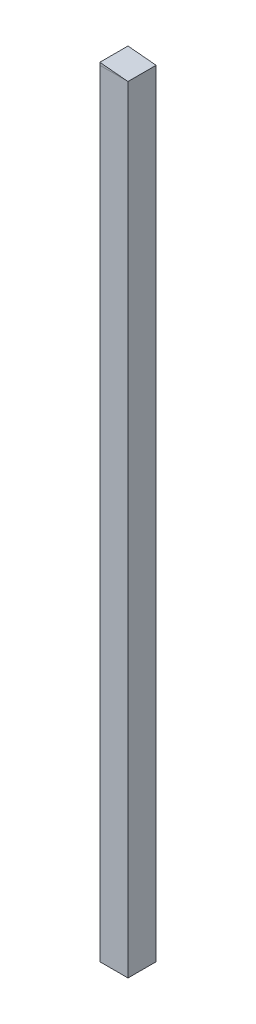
ISO-10303-21;
HEADER;
FILE_DESCRIPTION(('STEP AP214'),'2;1');
FILE_NAME('part.step','',(''),(''),'','','');
FILE_SCHEMA(('AUTOMOTIVE_DESIGN { 1 0 10303 214 1 1 1 1 }'));
ENDSEC;
DATA;
#1=APPLICATION_CONTEXT('core data for automotive mechanical design processes');
#2=APPLICATION_PROTOCOL_DEFINITION('international standard','automotive_design',2000,#1);
#3=PRODUCT_CONTEXT('',#1,'mechanical');
#4=PRODUCT('Part','Part','',(#3));
#5=PRODUCT_RELATED_PRODUCT_CATEGORY('part','',(#4));
#6=PRODUCT_DEFINITION_FORMATION('','',#4);
#7=PRODUCT_DEFINITION_CONTEXT('part definition',#1,'design');
#8=PRODUCT_DEFINITION('design','',#6,#7);
#9=PRODUCT_DEFINITION_SHAPE('','',#8);
#10=(LENGTH_UNIT() NAMED_UNIT(*) SI_UNIT(.MILLI.,.METRE.));
#11=(NAMED_UNIT(*) PLANE_ANGLE_UNIT() SI_UNIT($,.RADIAN.));
#12=(NAMED_UNIT(*) SI_UNIT($,.STERADIAN.) SOLID_ANGLE_UNIT());
#13=UNCERTAINTY_MEASURE_WITH_UNIT(LENGTH_MEASURE(1.E-05),#10,'distance_accuracy_value','');
#14=(GEOMETRIC_REPRESENTATION_CONTEXT(3) GLOBAL_UNCERTAINTY_ASSIGNED_CONTEXT((#13)) GLOBAL_UNIT_ASSIGNED_CONTEXT((#10,
#11,#12)) REPRESENTATION_CONTEXT('',''));
#15=CARTESIAN_POINT('',(0.,0.,0.));
#16=DIRECTION('',(0.,0.,1.));
#17=DIRECTION('',(1.,0.,0.));
#18=AXIS2_PLACEMENT_3D('',#15,#16,#17);
#19=CARTESIAN_POINT('',(0.,275.720020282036,-10.));
#20=DIRECTION('',(-0.000383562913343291,-0.999999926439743,0.));
#21=DIRECTION('',(0.999999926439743,-0.000383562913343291,0.));
#22=AXIS2_PLACEMENT_3D('',#19,#20,#21);
#23=PLANE('',#22);
#24=DIRECTION('',(0.999999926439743,-0.000383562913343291,0.));
#25=VECTOR('',#24,1.);
#26=CARTESIAN_POINT('',(0.,275.720020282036,0.));
#27=LINE('',#26,#25);
#28=CARTESIAN_POINT('',(0.,275.720020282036,0.));
#29=VERTEX_POINT('',#28);
#30=CARTESIAN_POINT('',(10.,275.71618465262,0.));
#31=VERTEX_POINT('',#30);
#32=EDGE_CURVE('E70',#29,#31,#27,.T.);
#33=ORIENTED_EDGE('',*,*,#32,.F.);
#34=DIRECTION('',(0.,0.,1.));
#35=VECTOR('',#34,1.);
#36=CARTESIAN_POINT('',(0.,275.720020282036,-10.));
#37=LINE('',#36,#35);
#38=CARTESIAN_POINT('',(0.,275.720020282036,-10.));
#39=VERTEX_POINT('',#38);
#40=EDGE_CURVE('E12',#39,#29,#37,.T.);
#41=ORIENTED_EDGE('',*,*,#40,.F.);
#42=DIRECTION('',(0.999999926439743,-0.000383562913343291,0.));
#43=VECTOR('',#42,1.);
#44=CARTESIAN_POINT('',(0.,275.720020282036,-10.));
#45=LINE('',#44,#43);
#46=CARTESIAN_POINT('',(10.,275.71618465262,-10.));
#47=VERTEX_POINT('',#46);
#48=EDGE_CURVE('E72',#39,#47,#45,.T.);
#49=ORIENTED_EDGE('',*,*,#48,.T.);
#50=DIRECTION('',(0.,0.,1.));
#51=VECTOR('',#50,1.);
#52=CARTESIAN_POINT('',(10.,275.71618465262,-10.));
#53=LINE('',#52,#51);
#54=EDGE_CURVE('E39',#47,#31,#53,.T.);
#55=ORIENTED_EDGE('',*,*,#54,.T.);
#56=EDGE_LOOP('',(#33,#41,#49,#55));
#57=FACE_BOUND('',#56,.T.);
#58=ADVANCED_FACE('F36',(#57),#23,.T.);
#59=CARTESIAN_POINT('',(0.,276.64596493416,-10.));
#60=DIRECTION('',(-1.,0.,0.));
#61=DIRECTION('',(0.,0.,1.));
#62=AXIS2_PLACEMENT_3D('',#59,#60,#61);
#63=PLANE('',#62);
#64=DIRECTION('',(0.,-1.,0.));
#65=VECTOR('',#64,1.);
#66=CARTESIAN_POINT('',(0.,276.64596493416,0.));
#67=LINE('',#66,#65);
#68=CARTESIAN_POINT('',(0.,276.64596493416,0.));
#69=VERTEX_POINT('',#68);
#70=EDGE_CURVE('E80',#69,#29,#67,.T.);
#71=ORIENTED_EDGE('',*,*,#70,.F.);
#72=DIRECTION('',(0.,0.,1.));
#73=VECTOR('',#72,1.);
#74=CARTESIAN_POINT('',(0.,276.64596493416,-10.));
#75=LINE('',#74,#73);
#76=CARTESIAN_POINT('',(0.,276.64596493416,-10.));
#77=VERTEX_POINT('',#76);
#78=EDGE_CURVE('E44',#77,#69,#75,.T.);
#79=ORIENTED_EDGE('',*,*,#78,.F.);
#80=DIRECTION('',(0.,-1.,0.));
#81=VECTOR('',#80,1.);
#82=CARTESIAN_POINT('',(0.,276.64596493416,-10.));
#83=LINE('',#82,#81);
#84=EDGE_CURVE('E75',#77,#39,#83,.T.);
#85=ORIENTED_EDGE('',*,*,#84,.T.);
#86=ORIENTED_EDGE('',*,*,#40,.T.);
#87=EDGE_LOOP('',(#71,#79,#85,#86));
#88=FACE_BOUND('',#87,.T.);
#89=ADVANCED_FACE('F90',(#88),#63,.T.);
#90=CARTESIAN_POINT('',(10.,275.71618465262,-10.));
#91=DIRECTION('',(0.0925787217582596,0.995705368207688,0.));
#92=DIRECTION('',(-0.995705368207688,0.0925787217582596,0.));
#93=AXIS2_PLACEMENT_3D('',#90,#91,#92);
#94=PLANE('',#93);
#95=DIRECTION('',(-0.995705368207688,0.0925787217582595,0.));
#96=VECTOR('',#95,1.);
#97=CARTESIAN_POINT('',(10.,275.71618465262,0.));
#98=LINE('',#97,#96);
#99=EDGE_CURVE('E77',#31,#69,#98,.T.);
#100=ORIENTED_EDGE('',*,*,#99,.F.);
#101=ORIENTED_EDGE('',*,*,#54,.F.);
#102=DIRECTION('',(-0.995705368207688,0.0925787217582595,0.));
#103=VECTOR('',#102,1.);
#104=CARTESIAN_POINT('',(10.,275.71618465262,-10.));
#105=LINE('',#104,#103);
#106=EDGE_CURVE('E87',#47,#77,#105,.T.);
#107=ORIENTED_EDGE('',*,*,#106,.T.);
#108=ORIENTED_EDGE('',*,*,#78,.T.);
#109=EDGE_LOOP('',(#100,#101,#107,#108));
#110=FACE_BOUND('',#109,.T.);
#111=ADVANCED_FACE('F78',(#110),#94,.T.);
#112=CARTESIAN_POINT('',(0.,275.720020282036,-10.));
#113=DIRECTION('',(0.,0.,-1.));
#114=DIRECTION('',(-1.,0.,0.));
#115=AXIS2_PLACEMENT_3D('',#112,#113,#114);
#116=PLANE('',#115);
#117=ORIENTED_EDGE('',*,*,#48,.F.);
#118=ORIENTED_EDGE('',*,*,#84,.F.);
#119=ORIENTED_EDGE('',*,*,#106,.F.);
#120=EDGE_LOOP('',(#117,#118,#119));
#121=FACE_BOUND('',#120,.T.);
#122=ADVANCED_FACE('F92',(#121),#116,.T.);
#123=CARTESIAN_POINT('',(0.,275.720020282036,0.));
#124=DIRECTION('',(0.,0.,-1.));
#125=DIRECTION('',(-1.,0.,0.));
#126=AXIS2_PLACEMENT_3D('',#123,#124,#125);
#127=PLANE('',#126);
#128=ORIENTED_EDGE('',*,*,#32,.T.);
#129=ORIENTED_EDGE('',*,*,#99,.T.);
#130=ORIENTED_EDGE('',*,*,#70,.T.);
#131=EDGE_LOOP('',(#128,#129,#130));
#132=FACE_BOUND('',#131,.T.);
#133=ADVANCED_FACE('F82',(#132),#127,.F.);
#134=CLOSED_SHELL('',(#58,#89,#111,#122,#133));
#135=MANIFOLD_SOLID_BREP('B2',#134);
#136=CARTESIAN_POINT('',(0.,275.72,0.));
#137=DIRECTION('',(1.,0.,0.));
#138=DIRECTION('',(0.,0.,-1.));
#139=AXIS2_PLACEMENT_3D('',#136,#137,#138);
#140=PLANE('',#139);
#141=DIRECTION('',(0.,0.,1.));
#142=VECTOR('',#141,1.);
#143=CARTESIAN_POINT('',(0.,0.,0.));
#144=LINE('',#143,#142);
#145=CARTESIAN_POINT('',(0.,0.,-10.));
#146=VERTEX_POINT('',#145);
#147=CARTESIAN_POINT('',(0.,0.,0.));
#148=VERTEX_POINT('',#147);
#149=EDGE_CURVE('E167',#146,#148,#144,.T.);
#150=ORIENTED_EDGE('',*,*,#149,.T.);
#151=DIRECTION('',(0.,-1.,0.));
#152=VECTOR('',#151,1.);
#153=CARTESIAN_POINT('',(0.,275.72,0.));
#154=LINE('',#153,#152);
#155=CARTESIAN_POINT('',(0.,275.72,0.));
#156=VERTEX_POINT('',#155);
#157=EDGE_CURVE('E34',#156,#148,#154,.T.);
#158=ORIENTED_EDGE('',*,*,#157,.F.);
#159=DIRECTION('',(0.,0.,1.));
#160=VECTOR('',#159,1.);
#161=CARTESIAN_POINT('',(0.,275.72,0.));
#162=LINE('',#161,#160);
#163=CARTESIAN_POINT('',(0.,275.72,-10.));
#164=VERTEX_POINT('',#163);
#165=EDGE_CURVE('E185',#164,#156,#162,.T.);
#166=ORIENTED_EDGE('',*,*,#165,.F.);
#167=DIRECTION('',(0.,-1.,0.));
#168=VECTOR('',#167,1.);
#169=CARTESIAN_POINT('',(0.,275.72,-10.));
#170=LINE('',#169,#168);
#171=EDGE_CURVE('E179',#164,#146,#170,.T.);
#172=ORIENTED_EDGE('',*,*,#171,.T.);
#173=EDGE_LOOP('',(#150,#158,#166,#172));
#174=FACE_BOUND('',#173,.T.);
#175=ADVANCED_FACE('F123',(#174),#140,.F.);
#176=CARTESIAN_POINT('',(0.,275.72,0.));
#177=DIRECTION('',(0.,0.,-1.));
#178=DIRECTION('',(-1.,0.,0.));
#179=AXIS2_PLACEMENT_3D('',#176,#177,#178);
#180=PLANE('',#179);
#181=DIRECTION('',(1.,0.,0.));
#182=VECTOR('',#181,1.);
#183=CARTESIAN_POINT('',(0.,0.,0.));
#184=LINE('',#183,#182);
#185=CARTESIAN_POINT('',(10.,0.,0.));
#186=VERTEX_POINT('',#185);
#187=EDGE_CURVE('E163',#148,#186,#184,.T.);
#188=ORIENTED_EDGE('',*,*,#187,.T.);
#189=DIRECTION('',(0.,-1.,0.));
#190=VECTOR('',#189,1.);
#191=CARTESIAN_POINT('',(10.,275.72,0.));
#192=LINE('',#191,#190);
#193=CARTESIAN_POINT('',(10.,275.72,0.));
#194=VERTEX_POINT('',#193);
#195=EDGE_CURVE('E130',#194,#186,#192,.T.);
#196=ORIENTED_EDGE('',*,*,#195,.F.);
#197=DIRECTION('',(1.,0.,0.));
#198=VECTOR('',#197,1.);
#199=CARTESIAN_POINT('',(0.,275.72,0.));
#200=LINE('',#199,#198);
#201=EDGE_CURVE('E175',#156,#194,#200,.T.);
#202=ORIENTED_EDGE('',*,*,#201,.F.);
#203=ORIENTED_EDGE('',*,*,#157,.T.);
#204=EDGE_LOOP('',(#188,#196,#202,#203));
#205=FACE_BOUND('',#204,.T.);
#206=ADVANCED_FACE('F174',(#205),#180,.F.);
#207=CARTESIAN_POINT('',(10.,275.72,0.));
#208=DIRECTION('',(-1.,0.,0.));
#209=DIRECTION('',(0.,0.,1.));
#210=AXIS2_PLACEMENT_3D('',#207,#208,#209);
#211=PLANE('',#210);
#212=DIRECTION('',(0.,0.,-1.));
#213=VECTOR('',#212,1.);
#214=CARTESIAN_POINT('',(10.,0.,0.));
#215=LINE('',#214,#213);
#216=CARTESIAN_POINT('',(10.,0.,-10.));
#217=VERTEX_POINT('',#216);
#218=EDGE_CURVE('E168',#186,#217,#215,.T.);
#219=ORIENTED_EDGE('',*,*,#218,.T.);
#220=DIRECTION('',(0.,-1.,0.));
#221=VECTOR('',#220,1.);
#222=CARTESIAN_POINT('',(10.,275.72,-10.));
#223=LINE('',#222,#221);
#224=CARTESIAN_POINT('',(10.,275.72,-10.));
#225=VERTEX_POINT('',#224);
#226=EDGE_CURVE('E191',#225,#217,#223,.T.);
#227=ORIENTED_EDGE('',*,*,#226,.F.);
#228=DIRECTION('',(0.,0.,-1.));
#229=VECTOR('',#228,1.);
#230=CARTESIAN_POINT('',(10.,275.72,0.));
#231=LINE('',#230,#229);
#232=EDGE_CURVE('E142',#194,#225,#231,.T.);
#233=ORIENTED_EDGE('',*,*,#232,.F.);
#234=ORIENTED_EDGE('',*,*,#195,.T.);
#235=EDGE_LOOP('',(#219,#227,#233,#234));
#236=FACE_BOUND('',#235,.T.);
#237=ADVANCED_FACE('F194',(#236),#211,.F.);
#238=CARTESIAN_POINT('',(0.,275.72,-10.));
#239=DIRECTION('',(0.,0.,1.));
#240=DIRECTION('',(1.,0.,0.));
#241=AXIS2_PLACEMENT_3D('',#238,#239,#240);
#242=PLANE('',#241);
#243=DIRECTION('',(-1.,0.,0.));
#244=VECTOR('',#243,1.);
#245=CARTESIAN_POINT('',(0.,0.,-10.));
#246=LINE('',#245,#244);
#247=EDGE_CURVE('E183',#217,#146,#246,.T.);
#248=ORIENTED_EDGE('',*,*,#247,.T.);
#249=ORIENTED_EDGE('',*,*,#171,.F.);
#250=DIRECTION('',(-1.,0.,0.));
#251=VECTOR('',#250,1.);
#252=CARTESIAN_POINT('',(0.,275.72,-10.));
#253=LINE('',#252,#251);
#254=EDGE_CURVE('E137',#225,#164,#253,.T.);
#255=ORIENTED_EDGE('',*,*,#254,.F.);
#256=ORIENTED_EDGE('',*,*,#226,.T.);
#257=EDGE_LOOP('',(#248,#249,#255,#256));
#258=FACE_BOUND('',#257,.T.);
#259=ADVANCED_FACE('F196',(#258),#242,.F.);
#260=CARTESIAN_POINT('',(0.,275.72,-10.));
#261=DIRECTION('',(0.,-1.,0.));
#262=DIRECTION('',(0.,0.,-1.));
#263=AXIS2_PLACEMENT_3D('',#260,#261,#262);
#264=PLANE('',#263);
#265=ORIENTED_EDGE('',*,*,#165,.T.);
#266=ORIENTED_EDGE('',*,*,#201,.T.);
#267=ORIENTED_EDGE('',*,*,#232,.T.);
#268=ORIENTED_EDGE('',*,*,#254,.T.);
#269=EDGE_LOOP('',(#265,#266,#267,#268));
#270=FACE_BOUND('',#269,.T.);
#271=ADVANCED_FACE('F197',(#270),#264,.F.);
#272=CARTESIAN_POINT('',(0.,0.,-10.));
#273=DIRECTION('',(0.,-1.,0.));
#274=DIRECTION('',(0.,0.,-1.));
#275=AXIS2_PLACEMENT_3D('',#272,#273,#274);
#276=PLANE('',#275);
#277=ORIENTED_EDGE('',*,*,#149,.F.);
#278=ORIENTED_EDGE('',*,*,#247,.F.);
#279=ORIENTED_EDGE('',*,*,#218,.F.);
#280=ORIENTED_EDGE('',*,*,#187,.F.);
#281=EDGE_LOOP('',(#277,#278,#279,#280));
#282=FACE_BOUND('',#281,.T.);
#283=ADVANCED_FACE('F164',(#282),#276,.T.);
#284=CLOSED_SHELL('',(#175,#206,#237,#259,#271,#283));
#285=MANIFOLD_SOLID_BREP('B6',#284);
#286=ADVANCED_BREP_SHAPE_REPRESENTATION('',(#18,#135,#285),#14);
#287=SHAPE_DEFINITION_REPRESENTATION(#9,#286);
ENDSEC;
END-ISO-10303-21;
